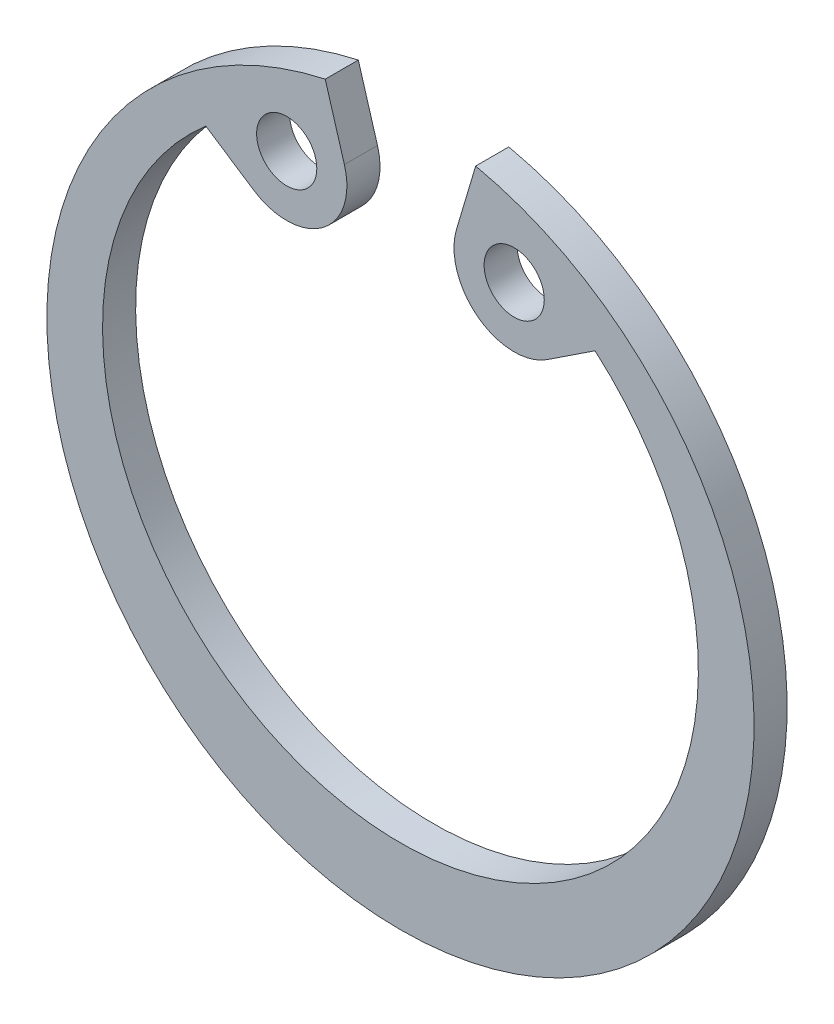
ISO-10303-21;
HEADER;
FILE_DESCRIPTION(('STEP AP214'),'2;1');
FILE_NAME('part.step','',(''),(''),'','','');
FILE_SCHEMA(('AUTOMOTIVE_DESIGN { 1 0 10303 214 1 1 1 1 }'));
ENDSEC;
DATA;
#1=APPLICATION_CONTEXT('core data for automotive mechanical design processes');
#2=APPLICATION_PROTOCOL_DEFINITION('international standard','automotive_design',2000,#1);
#3=PRODUCT_CONTEXT('',#1,'mechanical');
#4=PRODUCT('Part','Part','',(#3));
#5=PRODUCT_RELATED_PRODUCT_CATEGORY('part','',(#4));
#6=PRODUCT_DEFINITION_FORMATION('','',#4);
#7=PRODUCT_DEFINITION_CONTEXT('part definition',#1,'design');
#8=PRODUCT_DEFINITION('design','',#6,#7);
#9=PRODUCT_DEFINITION_SHAPE('','',#8);
#10=(LENGTH_UNIT() NAMED_UNIT(*) SI_UNIT(.MILLI.,.METRE.));
#11=(NAMED_UNIT(*) PLANE_ANGLE_UNIT() SI_UNIT($,.RADIAN.));
#12=(NAMED_UNIT(*) SI_UNIT($,.STERADIAN.) SOLID_ANGLE_UNIT());
#13=UNCERTAINTY_MEASURE_WITH_UNIT(LENGTH_MEASURE(1.E-05),#10,'distance_accuracy_value','');
#14=(GEOMETRIC_REPRESENTATION_CONTEXT(3) GLOBAL_UNCERTAINTY_ASSIGNED_CONTEXT((#13)) GLOBAL_UNIT_ASSIGNED_CONTEXT((#10,
#11,#12)) REPRESENTATION_CONTEXT('',''));
#15=CARTESIAN_POINT('',(0.,0.,0.));
#16=DIRECTION('',(0.,0.,1.));
#17=DIRECTION('',(1.,0.,0.));
#18=AXIS2_PLACEMENT_3D('',#15,#16,#17);
#19=CARTESIAN_POINT('',(-2.98370328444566,1.96218162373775,1.09999999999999));
#20=DIRECTION('',(0.,0.,-1.));
#21=DIRECTION('',(-1.,0.,0.));
#22=AXIS2_PLACEMENT_3D('',#19,#20,#21);
#23=PLANE('',#22);
#24=CARTESIAN_POINT('',(-2.98370328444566,1.96218162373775,1.09999999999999));
#25=DIRECTION('',(0.,0.,1.));
#26=DIRECTION('',(1.,0.,0.));
#27=AXIS2_PLACEMENT_3D('',#24,#25,#26);
#28=CIRCLE('',#27,0.999999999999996);
#29=CARTESIAN_POINT('',(-1.98370328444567,1.96218162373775,1.09999999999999));
#30=VERTEX_POINT('',#29);
#31=EDGE_CURVE('E141',#30,#30,#28,.T.);
#32=ORIENTED_EDGE('',*,*,#31,.F.);
#33=EDGE_LOOP('',(#32));
#34=FACE_BOUND('',#33,.T.);
#35=CARTESIAN_POINT('',(-2.98370328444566,1.96218162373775,1.09999999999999));
#36=DIRECTION('',(0.,0.,-1.));
#37=DIRECTION('',(-1.,0.,0.));
#38=AXIS2_PLACEMENT_3D('',#35,#36,#37);
#39=CIRCLE('',#38,2.);
#40=CARTESIAN_POINT('',(-1.88221922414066,0.292830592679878,1.09999999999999));
#41=VERTEX_POINT('',#40);
#42=CARTESIAN_POINT('',(-4.90052718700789,2.5329583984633,1.09999999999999));
#43=VERTEX_POINT('',#42);
#44=EDGE_CURVE('E157',#41,#43,#39,.T.);
#45=ORIENTED_EDGE('',*,*,#44,.F.);
#46=DIRECTION('',(-0.834675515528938,-0.550742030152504,0.));
#47=VECTOR('',#46,1.);
#48=CARTESIAN_POINT('',(-0.297265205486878,1.33862716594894,1.09999999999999));
#49=LINE('',#48,#47);
#50=CARTESIAN_POINT('',(-0.297265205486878,1.33862716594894,1.09999999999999));
#51=VERTEX_POINT('',#50);
#52=EDGE_CURVE('E130',#51,#41,#49,.T.);
#53=ORIENTED_EDGE('',*,*,#52,.F.);
#54=CARTESIAN_POINT('',(-6.7633102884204,-6.15805616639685,1.09999999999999));
#55=DIRECTION('',(0.,0.,1.));
#56=DIRECTION('',(1.,0.,0.));
#57=AXIS2_PLACEMENT_3D('',#54,#55,#56);
#58=CIRCLE('',#57,9.9);
#59=CARTESIAN_POINT('',(-13.2293553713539,1.33862716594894,1.09999999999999));
#60=VERTEX_POINT('',#59);
#61=EDGE_CURVE('E114',#60,#51,#58,.T.);
#62=ORIENTED_EDGE('',*,*,#61,.F.);
#63=DIRECTION('',(0.834675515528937,-0.550742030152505,0.));
#64=VECTOR('',#63,1.);
#65=CARTESIAN_POINT('',(-13.2293553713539,1.33862716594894,1.09999999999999));
#66=LINE('',#65,#64);
#67=CARTESIAN_POINT('',(-11.6444013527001,0.292830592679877,1.09999999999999));
#68=VERTEX_POINT('',#67);
#69=EDGE_CURVE('E122',#60,#68,#66,.T.);
#70=ORIENTED_EDGE('',*,*,#69,.T.);
#71=CARTESIAN_POINT('',(-10.5429172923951,1.96218162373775,1.09999999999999));
#72=DIRECTION('',(0.,0.,1.));
#73=DIRECTION('',(1.,0.,0.));
#74=AXIS2_PLACEMENT_3D('',#71,#72,#73);
#75=CIRCLE('',#74,2.);
#76=CARTESIAN_POINT('',(-8.62609338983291,2.5329583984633,1.09999999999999));
#77=VERTEX_POINT('',#76);
#78=EDGE_CURVE('E127',#68,#77,#75,.T.);
#79=ORIENTED_EDGE('',*,*,#78,.T.);
#80=DIRECTION('',(-0.285388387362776,0.958411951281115,0.));
#81=VECTOR('',#80,1.);
#82=CARTESIAN_POINT('',(-8.62609338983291,2.5329583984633,1.09999999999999));
#83=LINE('',#82,#81);
#84=CARTESIAN_POINT('',(-9.2633102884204,4.67290633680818,1.09999999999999));
#85=VERTEX_POINT('',#84);
#86=EDGE_CURVE('E220',#77,#85,#83,.T.);
#87=ORIENTED_EDGE('',*,*,#86,.T.);
#88=CARTESIAN_POINT('',(-6.7633102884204,-6.80805616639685,1.09999999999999));
#89=DIRECTION('',(0.,0.,1.));
#90=DIRECTION('',(1.,0.,0.));
#91=AXIS2_PLACEMENT_3D('',#88,#89,#90);
#92=CIRCLE('',#91,11.75);
#93=CARTESIAN_POINT('',(-4.26331028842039,4.67290633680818,1.09999999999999));
#94=VERTEX_POINT('',#93);
#95=EDGE_CURVE('E218',#85,#94,#92,.T.);
#96=ORIENTED_EDGE('',*,*,#95,.T.);
#97=DIRECTION('',(0.285388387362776,0.958411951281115,0.));
#98=VECTOR('',#97,1.);
#99=CARTESIAN_POINT('',(-4.90052718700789,2.5329583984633,1.09999999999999));
#100=LINE('',#99,#98);
#101=EDGE_CURVE('E216',#43,#94,#100,.T.);
#102=ORIENTED_EDGE('',*,*,#101,.F.);
#103=EDGE_LOOP('',(#45,#53,#62,#70,#79,#87,#96,#102));
#104=FACE_BOUND('',#103,.T.);
#105=CARTESIAN_POINT('',(-10.5429172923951,1.96218162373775,1.09999999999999));
#106=DIRECTION('',(0.,0.,1.));
#107=DIRECTION('',(1.,0.,0.));
#108=AXIS2_PLACEMENT_3D('',#105,#106,#107);
#109=CIRCLE('',#108,1.00000000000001);
#110=CARTESIAN_POINT('',(-9.54291729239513,1.96218162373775,1.09999999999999));
#111=VERTEX_POINT('',#110);
#112=EDGE_CURVE('E203',#111,#111,#109,.T.);
#113=ORIENTED_EDGE('',*,*,#112,.F.);
#114=EDGE_LOOP('',(#113));
#115=FACE_BOUND('',#114,.T.);
#116=ADVANCED_FACE('F40',(#34,#104,#115),#23,.F.);
#117=CARTESIAN_POINT('',(-2.98370328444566,1.96218162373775,0.));
#118=DIRECTION('',(0.,0.,-1.));
#119=DIRECTION('',(-1.,0.,0.));
#120=AXIS2_PLACEMENT_3D('',#117,#118,#119);
#121=PLANE('',#120);
#122=CARTESIAN_POINT('',(-2.98370328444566,1.96218162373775,0.));
#123=DIRECTION('',(0.,0.,1.));
#124=DIRECTION('',(1.,0.,0.));
#125=AXIS2_PLACEMENT_3D('',#122,#123,#124);
#126=CIRCLE('',#125,0.999999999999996);
#127=CARTESIAN_POINT('',(-1.98370328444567,1.96218162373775,0.));
#128=VERTEX_POINT('',#127);
#129=EDGE_CURVE('E208',#128,#128,#126,.T.);
#130=ORIENTED_EDGE('',*,*,#129,.T.);
#131=EDGE_LOOP('',(#130));
#132=FACE_BOUND('',#131,.T.);
#133=CARTESIAN_POINT('',(-2.98370328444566,1.96218162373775,0.));
#134=DIRECTION('',(0.,0.,-1.));
#135=DIRECTION('',(-1.,0.,0.));
#136=AXIS2_PLACEMENT_3D('',#133,#134,#135);
#137=CIRCLE('',#136,2.);
#138=CARTESIAN_POINT('',(-1.88221922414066,0.292830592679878,0.));
#139=VERTEX_POINT('',#138);
#140=CARTESIAN_POINT('',(-4.90052718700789,2.5329583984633,0.));
#141=VERTEX_POINT('',#140);
#142=EDGE_CURVE('E137',#139,#141,#137,.T.);
#143=ORIENTED_EDGE('',*,*,#142,.T.);
#144=DIRECTION('',(0.285388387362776,0.958411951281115,0.));
#145=VECTOR('',#144,1.);
#146=CARTESIAN_POINT('',(-4.90052718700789,2.5329583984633,0.));
#147=LINE('',#146,#145);
#148=CARTESIAN_POINT('',(-4.26331028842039,4.67290633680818,0.));
#149=VERTEX_POINT('',#148);
#150=EDGE_CURVE('E140',#141,#149,#147,.T.);
#151=ORIENTED_EDGE('',*,*,#150,.T.);
#152=CARTESIAN_POINT('',(-6.7633102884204,-6.80805616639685,0.));
#153=DIRECTION('',(0.,0.,1.));
#154=DIRECTION('',(1.,0.,0.));
#155=AXIS2_PLACEMENT_3D('',#152,#153,#154);
#156=CIRCLE('',#155,11.75);
#157=CARTESIAN_POINT('',(-9.2633102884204,4.67290633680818,0.));
#158=VERTEX_POINT('',#157);
#159=EDGE_CURVE('E144',#158,#149,#156,.T.);
#160=ORIENTED_EDGE('',*,*,#159,.F.);
#161=DIRECTION('',(-0.285388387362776,0.958411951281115,0.));
#162=VECTOR('',#161,1.);
#163=CARTESIAN_POINT('',(-8.62609338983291,2.5329583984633,0.));
#164=LINE('',#163,#162);
#165=CARTESIAN_POINT('',(-8.62609338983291,2.5329583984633,0.));
#166=VERTEX_POINT('',#165);
#167=EDGE_CURVE('E148',#166,#158,#164,.T.);
#168=ORIENTED_EDGE('',*,*,#167,.F.);
#169=CARTESIAN_POINT('',(-10.5429172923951,1.96218162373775,0.));
#170=DIRECTION('',(0.,0.,1.));
#171=DIRECTION('',(1.,0.,0.));
#172=AXIS2_PLACEMENT_3D('',#169,#170,#171);
#173=CIRCLE('',#172,2.);
#174=CARTESIAN_POINT('',(-11.6444013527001,0.292830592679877,0.));
#175=VERTEX_POINT('',#174);
#176=EDGE_CURVE('E150',#175,#166,#173,.T.);
#177=ORIENTED_EDGE('',*,*,#176,.F.);
#178=DIRECTION('',(0.834675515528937,-0.550742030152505,0.));
#179=VECTOR('',#178,1.);
#180=CARTESIAN_POINT('',(-13.2293553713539,1.33862716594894,0.));
#181=LINE('',#180,#179);
#182=CARTESIAN_POINT('',(-13.2293553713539,1.33862716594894,0.));
#183=VERTEX_POINT('',#182);
#184=EDGE_CURVE('E152',#183,#175,#181,.T.);
#185=ORIENTED_EDGE('',*,*,#184,.F.);
#186=CARTESIAN_POINT('',(-6.7633102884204,-6.15805616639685,0.));
#187=DIRECTION('',(0.,0.,1.));
#188=DIRECTION('',(1.,0.,0.));
#189=AXIS2_PLACEMENT_3D('',#186,#187,#188);
#190=CIRCLE('',#189,9.9);
#191=CARTESIAN_POINT('',(-0.297265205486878,1.33862716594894,0.));
#192=VERTEX_POINT('',#191);
#193=EDGE_CURVE('E116',#183,#192,#190,.T.);
#194=ORIENTED_EDGE('',*,*,#193,.T.);
#195=DIRECTION('',(-0.834675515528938,-0.550742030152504,0.));
#196=VECTOR('',#195,1.);
#197=CARTESIAN_POINT('',(-0.297265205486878,1.33862716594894,0.));
#198=LINE('',#197,#196);
#199=EDGE_CURVE('E155',#192,#139,#198,.T.);
#200=ORIENTED_EDGE('',*,*,#199,.T.);
#201=EDGE_LOOP('',(#143,#151,#160,#168,#177,#185,#194,#200));
#202=FACE_BOUND('',#201,.T.);
#203=CARTESIAN_POINT('',(-10.5429172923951,1.96218162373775,0.));
#204=DIRECTION('',(0.,0.,1.));
#205=DIRECTION('',(1.,0.,0.));
#206=AXIS2_PLACEMENT_3D('',#203,#204,#205);
#207=CIRCLE('',#206,1.00000000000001);
#208=CARTESIAN_POINT('',(-9.54291729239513,1.96218162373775,0.));
#209=VERTEX_POINT('',#208);
#210=EDGE_CURVE('E206',#209,#209,#207,.T.);
#211=ORIENTED_EDGE('',*,*,#210,.T.);
#212=EDGE_LOOP('',(#211));
#213=FACE_BOUND('',#212,.T.);
#214=ADVANCED_FACE('F171',(#132,#202,#213),#121,.T.);
#215=CARTESIAN_POINT('',(-2.98370328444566,1.96218162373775,1.09999999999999));
#216=DIRECTION('',(0.,0.,-1.));
#217=DIRECTION('',(-1.,0.,0.));
#218=AXIS2_PLACEMENT_3D('',#215,#216,#217);
#219=CYLINDRICAL_SURFACE('',#218,2.);
#220=ORIENTED_EDGE('',*,*,#142,.F.);
#221=DIRECTION('',(0.,0.,-1.));
#222=VECTOR('',#221,1.);
#223=CARTESIAN_POINT('',(-1.88221922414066,0.292830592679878,1.09999999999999));
#224=LINE('',#223,#222);
#225=EDGE_CURVE('E11',#41,#139,#224,.T.);
#226=ORIENTED_EDGE('',*,*,#225,.F.);
#227=ORIENTED_EDGE('',*,*,#44,.T.);
#228=DIRECTION('',(0.,0.,-1.));
#229=VECTOR('',#228,1.);
#230=CARTESIAN_POINT('',(-4.90052718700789,2.5329583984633,1.09999999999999));
#231=LINE('',#230,#229);
#232=EDGE_CURVE('E44',#43,#141,#231,.T.);
#233=ORIENTED_EDGE('',*,*,#232,.T.);
#234=EDGE_LOOP('',(#220,#226,#227,#233));
#235=FACE_BOUND('',#234,.T.);
#236=ADVANCED_FACE('F42',(#235),#219,.T.);
#237=CARTESIAN_POINT('',(-0.297265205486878,1.33862716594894,1.09999999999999));
#238=DIRECTION('',(0.550742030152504,-0.834675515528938,0.));
#239=DIRECTION('',(0.834675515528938,0.550742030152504,0.));
#240=AXIS2_PLACEMENT_3D('',#237,#238,#239);
#241=PLANE('',#240);
#242=ORIENTED_EDGE('',*,*,#199,.F.);
#243=DIRECTION('',(0.,0.,-1.));
#244=VECTOR('',#243,1.);
#245=CARTESIAN_POINT('',(-0.297265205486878,1.33862716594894,1.09999999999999));
#246=LINE('',#245,#244);
#247=EDGE_CURVE('E50',#51,#192,#246,.T.);
#248=ORIENTED_EDGE('',*,*,#247,.F.);
#249=ORIENTED_EDGE('',*,*,#52,.T.);
#250=ORIENTED_EDGE('',*,*,#225,.T.);
#251=EDGE_LOOP('',(#242,#248,#249,#250));
#252=FACE_BOUND('',#251,.T.);
#253=ADVANCED_FACE('F173',(#252),#241,.T.);
#254=CARTESIAN_POINT('',(-6.7633102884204,-6.15805616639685,1.09999999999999));
#255=DIRECTION('',(0.,0.,-1.));
#256=DIRECTION('',(-1.,0.,0.));
#257=AXIS2_PLACEMENT_3D('',#254,#255,#256);
#258=CYLINDRICAL_SURFACE('',#257,9.9);
#259=ORIENTED_EDGE('',*,*,#193,.F.);
#260=DIRECTION('',(0.,0.,-1.));
#261=VECTOR('',#260,1.);
#262=CARTESIAN_POINT('',(-13.2293553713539,1.33862716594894,1.09999999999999));
#263=LINE('',#262,#261);
#264=EDGE_CURVE('E110',#60,#183,#263,.T.);
#265=ORIENTED_EDGE('',*,*,#264,.F.);
#266=ORIENTED_EDGE('',*,*,#61,.T.);
#267=ORIENTED_EDGE('',*,*,#247,.T.);
#268=EDGE_LOOP('',(#259,#265,#266,#267));
#269=FACE_BOUND('',#268,.T.);
#270=ADVANCED_FACE('F112',(#269),#258,.F.);
#271=CARTESIAN_POINT('',(-13.2293553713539,1.33862716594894,1.09999999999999));
#272=DIRECTION('',(0.550742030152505,0.834675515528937,0.));
#273=DIRECTION('',(-0.834675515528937,0.550742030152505,0.));
#274=AXIS2_PLACEMENT_3D('',#271,#272,#273);
#275=PLANE('',#274);
#276=ORIENTED_EDGE('',*,*,#184,.T.);
#277=DIRECTION('',(0.,0.,-1.));
#278=VECTOR('',#277,1.);
#279=CARTESIAN_POINT('',(-11.6444013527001,0.292830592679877,1.09999999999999));
#280=LINE('',#279,#278);
#281=EDGE_CURVE('E119',#68,#175,#280,.T.);
#282=ORIENTED_EDGE('',*,*,#281,.F.);
#283=ORIENTED_EDGE('',*,*,#69,.F.);
#284=ORIENTED_EDGE('',*,*,#264,.T.);
#285=EDGE_LOOP('',(#276,#282,#283,#284));
#286=FACE_BOUND('',#285,.T.);
#287=ADVANCED_FACE('F123',(#286),#275,.F.);
#288=CARTESIAN_POINT('',(-10.5429172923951,1.96218162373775,1.09999999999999));
#289=DIRECTION('',(0.,0.,-1.));
#290=DIRECTION('',(-1.,0.,0.));
#291=AXIS2_PLACEMENT_3D('',#288,#289,#290);
#292=CYLINDRICAL_SURFACE('',#291,2.);
#293=ORIENTED_EDGE('',*,*,#176,.T.);
#294=DIRECTION('',(0.,0.,-1.));
#295=VECTOR('',#294,1.);
#296=CARTESIAN_POINT('',(-8.62609338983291,2.5329583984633,1.09999999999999));
#297=LINE('',#296,#295);
#298=EDGE_CURVE('E161',#77,#166,#297,.T.);
#299=ORIENTED_EDGE('',*,*,#298,.F.);
#300=ORIENTED_EDGE('',*,*,#78,.F.);
#301=ORIENTED_EDGE('',*,*,#281,.T.);
#302=EDGE_LOOP('',(#293,#299,#300,#301));
#303=FACE_BOUND('',#302,.T.);
#304=ADVANCED_FACE('F225',(#303),#292,.T.);
#305=CARTESIAN_POINT('',(-8.62609338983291,2.5329583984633,1.09999999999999));
#306=DIRECTION('',(-0.958411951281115,-0.285388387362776,0.));
#307=DIRECTION('',(0.285388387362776,-0.958411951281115,0.));
#308=AXIS2_PLACEMENT_3D('',#305,#306,#307);
#309=PLANE('',#308);
#310=ORIENTED_EDGE('',*,*,#167,.T.);
#311=DIRECTION('',(0.,0.,-1.));
#312=VECTOR('',#311,1.);
#313=CARTESIAN_POINT('',(-9.2633102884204,4.67290633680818,1.09999999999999));
#314=LINE('',#313,#312);
#315=EDGE_CURVE('E164',#85,#158,#314,.T.);
#316=ORIENTED_EDGE('',*,*,#315,.F.);
#317=ORIENTED_EDGE('',*,*,#86,.F.);
#318=ORIENTED_EDGE('',*,*,#298,.T.);
#319=EDGE_LOOP('',(#310,#316,#317,#318));
#320=FACE_BOUND('',#319,.T.);
#321=ADVANCED_FACE('F229',(#320),#309,.F.);
#322=CARTESIAN_POINT('',(-6.7633102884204,-6.80805616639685,1.09999999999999));
#323=DIRECTION('',(0.,0.,-1.));
#324=DIRECTION('',(-1.,0.,0.));
#325=AXIS2_PLACEMENT_3D('',#322,#323,#324);
#326=CYLINDRICAL_SURFACE('',#325,11.75);
#327=ORIENTED_EDGE('',*,*,#159,.T.);
#328=DIRECTION('',(0.,0.,-1.));
#329=VECTOR('',#328,1.);
#330=CARTESIAN_POINT('',(-4.26331028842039,4.67290633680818,1.09999999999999));
#331=LINE('',#330,#329);
#332=EDGE_CURVE('E166',#94,#149,#331,.T.);
#333=ORIENTED_EDGE('',*,*,#332,.F.);
#334=ORIENTED_EDGE('',*,*,#95,.F.);
#335=ORIENTED_EDGE('',*,*,#315,.T.);
#336=EDGE_LOOP('',(#327,#333,#334,#335));
#337=FACE_BOUND('',#336,.T.);
#338=ADVANCED_FACE('F232',(#337),#326,.T.);
#339=CARTESIAN_POINT('',(-4.90052718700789,2.5329583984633,1.09999999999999));
#340=DIRECTION('',(-0.958411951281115,0.285388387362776,0.));
#341=DIRECTION('',(-0.285388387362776,-0.958411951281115,0.));
#342=AXIS2_PLACEMENT_3D('',#339,#340,#341);
#343=PLANE('',#342);
#344=ORIENTED_EDGE('',*,*,#150,.F.);
#345=ORIENTED_EDGE('',*,*,#232,.F.);
#346=ORIENTED_EDGE('',*,*,#101,.T.);
#347=ORIENTED_EDGE('',*,*,#332,.T.);
#348=EDGE_LOOP('',(#344,#345,#346,#347));
#349=FACE_BOUND('',#348,.T.);
#350=ADVANCED_FACE('F168',(#349),#343,.T.);
#351=CARTESIAN_POINT('',(-2.98370328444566,1.96218162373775,1.09999999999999));
#352=DIRECTION('',(0.,0.,-1.));
#353=DIRECTION('',(-1.,0.,0.));
#354=AXIS2_PLACEMENT_3D('',#351,#352,#353);
#355=CYLINDRICAL_SURFACE('',#354,0.999999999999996);
#356=ORIENTED_EDGE('',*,*,#31,.T.);
#357=EDGE_LOOP('',(#356));
#358=FACE_BOUND('',#357,.T.);
#359=ORIENTED_EDGE('',*,*,#129,.F.);
#360=EDGE_LOOP('',(#359));
#361=FACE_BOUND('',#360,.T.);
#362=ADVANCED_FACE('F191',(#358,#361),#355,.F.);
#363=CARTESIAN_POINT('',(-10.5429172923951,1.96218162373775,1.09999999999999));
#364=DIRECTION('',(0.,0.,-1.));
#365=DIRECTION('',(-1.,0.,0.));
#366=AXIS2_PLACEMENT_3D('',#363,#364,#365);
#367=CYLINDRICAL_SURFACE('',#366,1.00000000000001);
#368=ORIENTED_EDGE('',*,*,#112,.T.);
#369=EDGE_LOOP('',(#368));
#370=FACE_BOUND('',#369,.T.);
#371=ORIENTED_EDGE('',*,*,#210,.F.);
#372=EDGE_LOOP('',(#371));
#373=FACE_BOUND('',#372,.T.);
#374=ADVANCED_FACE('F194',(#370,#373),#367,.F.);
#375=CLOSED_SHELL('',(#116,#214,#236,#253,#270,#287,#304,#321,#338,#350,#362,#374));
#376=MANIFOLD_SOLID_BREP('B2',#375);
#377=ADVANCED_BREP_SHAPE_REPRESENTATION('',(#18,#376),#14);
#378=SHAPE_DEFINITION_REPRESENTATION(#9,#377);
ENDSEC;
END-ISO-10303-21;
